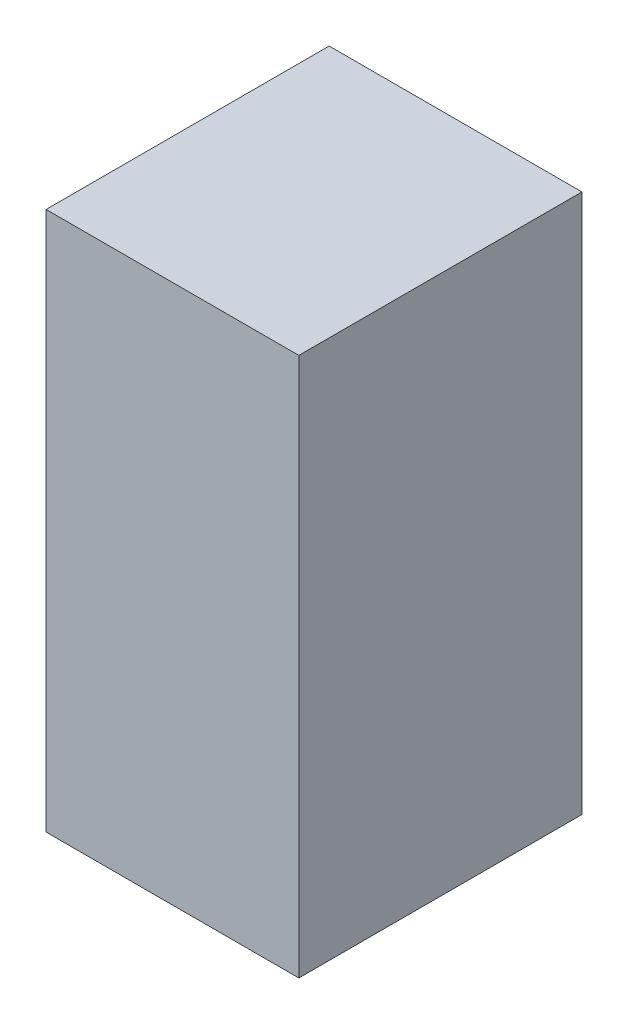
ISO-10303-21;
HEADER;
FILE_DESCRIPTION(('STEP AP214'),'2;1');
FILE_NAME('part.step','',(''),(''),'','','');
FILE_SCHEMA(('AUTOMOTIVE_DESIGN { 1 0 10303 214 1 1 1 1 }'));
ENDSEC;
DATA;
#1=APPLICATION_CONTEXT('core data for automotive mechanical design processes');
#2=APPLICATION_PROTOCOL_DEFINITION('international standard','automotive_design',2000,#1);
#3=PRODUCT_CONTEXT('',#1,'mechanical');
#4=PRODUCT('Part','Part','',(#3));
#5=PRODUCT_RELATED_PRODUCT_CATEGORY('part','',(#4));
#6=PRODUCT_DEFINITION_FORMATION('','',#4);
#7=PRODUCT_DEFINITION_CONTEXT('part definition',#1,'design');
#8=PRODUCT_DEFINITION('design','',#6,#7);
#9=PRODUCT_DEFINITION_SHAPE('','',#8);
#10=(LENGTH_UNIT() NAMED_UNIT(*) SI_UNIT(.MILLI.,.METRE.));
#11=(NAMED_UNIT(*) PLANE_ANGLE_UNIT() SI_UNIT($,.RADIAN.));
#12=(NAMED_UNIT(*) SI_UNIT($,.STERADIAN.) SOLID_ANGLE_UNIT());
#13=UNCERTAINTY_MEASURE_WITH_UNIT(LENGTH_MEASURE(1.E-05),#10,'distance_accuracy_value','');
#14=(GEOMETRIC_REPRESENTATION_CONTEXT(3) GLOBAL_UNCERTAINTY_ASSIGNED_CONTEXT((#13)) GLOBAL_UNIT_ASSIGNED_CONTEXT((#10,
#11,#12)) REPRESENTATION_CONTEXT('',''));
#15=CARTESIAN_POINT('',(0.,0.,0.));
#16=DIRECTION('',(0.,0.,1.));
#17=DIRECTION('',(1.,0.,0.));
#18=AXIS2_PLACEMENT_3D('',#15,#16,#17);
#19=CARTESIAN_POINT('',(-9.52499999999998,40.6400000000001,-10.668));
#20=DIRECTION('',(1.,0.,0.));
#21=DIRECTION('',(0.,0.,-1.));
#22=AXIS2_PLACEMENT_3D('',#19,#20,#21);
#23=PLANE('',#22);
#24=DIRECTION('',(0.,0.,1.));
#25=VECTOR('',#24,1.);
#26=CARTESIAN_POINT('',(-9.52500000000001,0.,-10.668));
#27=LINE('',#26,#25);
#28=CARTESIAN_POINT('',(-9.52500000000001,0.,-10.668));
#29=VERTEX_POINT('',#28);
#30=CARTESIAN_POINT('',(-9.52500000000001,0.,10.668));
#31=VERTEX_POINT('',#30);
#32=EDGE_CURVE('E78',#29,#31,#27,.T.);
#33=ORIENTED_EDGE('',*,*,#32,.T.);
#34=DIRECTION('',(0.,-1.,0.));
#35=VECTOR('',#34,1.);
#36=CARTESIAN_POINT('',(-9.52499999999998,40.64,10.668));
#37=LINE('',#36,#35);
#38=CARTESIAN_POINT('',(-9.52499999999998,40.64,10.668));
#39=VERTEX_POINT('',#38);
#40=EDGE_CURVE('E11',#39,#31,#37,.T.);
#41=ORIENTED_EDGE('',*,*,#40,.F.);
#42=DIRECTION('',(0.,0.,1.));
#43=VECTOR('',#42,1.);
#44=CARTESIAN_POINT('',(-9.52499999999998,40.6400000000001,-10.668));
#45=LINE('',#44,#43);
#46=CARTESIAN_POINT('',(-9.52499999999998,40.6400000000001,-10.668));
#47=VERTEX_POINT('',#46);
#48=EDGE_CURVE('E96',#47,#39,#45,.T.);
#49=ORIENTED_EDGE('',*,*,#48,.F.);
#50=DIRECTION('',(0.,-1.,0.));
#51=VECTOR('',#50,1.);
#52=CARTESIAN_POINT('',(-9.52499999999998,40.6400000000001,-10.668));
#53=LINE('',#52,#51);
#54=EDGE_CURVE('E90',#47,#29,#53,.T.);
#55=ORIENTED_EDGE('',*,*,#54,.T.);
#56=EDGE_LOOP('',(#33,#41,#49,#55));
#57=FACE_BOUND('',#56,.T.);
#58=ADVANCED_FACE('F34',(#57),#23,.F.);
#59=CARTESIAN_POINT('',(-9.52499999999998,40.64,10.668));
#60=DIRECTION('',(0.,0.,-1.));
#61=DIRECTION('',(-1.,0.,0.));
#62=AXIS2_PLACEMENT_3D('',#59,#60,#61);
#63=PLANE('',#62);
#64=DIRECTION('',(1.,0.,0.));
#65=VECTOR('',#64,1.);
#66=CARTESIAN_POINT('',(-9.52500000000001,0.,10.668));
#67=LINE('',#66,#65);
#68=CARTESIAN_POINT('',(9.52499999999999,0.,10.668));
#69=VERTEX_POINT('',#68);
#70=EDGE_CURVE('E74',#31,#69,#67,.T.);
#71=ORIENTED_EDGE('',*,*,#70,.T.);
#72=DIRECTION('',(0.,-1.,0.));
#73=VECTOR('',#72,1.);
#74=CARTESIAN_POINT('',(9.52500000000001,40.64,10.668));
#75=LINE('',#74,#73);
#76=CARTESIAN_POINT('',(9.52500000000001,40.64,10.668));
#77=VERTEX_POINT('',#76);
#78=EDGE_CURVE('E41',#77,#69,#75,.T.);
#79=ORIENTED_EDGE('',*,*,#78,.F.);
#80=DIRECTION('',(1.,0.,0.));
#81=VECTOR('',#80,1.);
#82=CARTESIAN_POINT('',(-9.52499999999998,40.64,10.668));
#83=LINE('',#82,#81);
#84=EDGE_CURVE('E86',#39,#77,#83,.T.);
#85=ORIENTED_EDGE('',*,*,#84,.F.);
#86=ORIENTED_EDGE('',*,*,#40,.T.);
#87=EDGE_LOOP('',(#71,#79,#85,#86));
#88=FACE_BOUND('',#87,.T.);
#89=ADVANCED_FACE('F85',(#88),#63,.F.);
#90=CARTESIAN_POINT('',(9.52500000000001,40.64,-10.668));
#91=DIRECTION('',(-1.,0.,0.));
#92=DIRECTION('',(0.,0.,1.));
#93=AXIS2_PLACEMENT_3D('',#90,#91,#92);
#94=PLANE('',#93);
#95=DIRECTION('',(0.,0.,-1.));
#96=VECTOR('',#95,1.);
#97=CARTESIAN_POINT('',(9.52499999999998,0.,-10.668));
#98=LINE('',#97,#96);
#99=CARTESIAN_POINT('',(9.52499999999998,0.,-10.668));
#100=VERTEX_POINT('',#99);
#101=EDGE_CURVE('E79',#69,#100,#98,.T.);
#102=ORIENTED_EDGE('',*,*,#101,.T.);
#103=DIRECTION('',(0.,-1.,0.));
#104=VECTOR('',#103,1.);
#105=CARTESIAN_POINT('',(9.52500000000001,40.64,-10.668));
#106=LINE('',#105,#104);
#107=CARTESIAN_POINT('',(9.52500000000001,40.64,-10.668));
#108=VERTEX_POINT('',#107);
#109=EDGE_CURVE('E102',#108,#100,#106,.T.);
#110=ORIENTED_EDGE('',*,*,#109,.F.);
#111=DIRECTION('',(0.,0.,-1.));
#112=VECTOR('',#111,1.);
#113=CARTESIAN_POINT('',(9.52500000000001,40.64,-10.668));
#114=LINE('',#113,#112);
#115=EDGE_CURVE('E53',#77,#108,#114,.T.);
#116=ORIENTED_EDGE('',*,*,#115,.F.);
#117=ORIENTED_EDGE('',*,*,#78,.T.);
#118=EDGE_LOOP('',(#102,#110,#116,#117));
#119=FACE_BOUND('',#118,.T.);
#120=ADVANCED_FACE('F105',(#119),#94,.F.);
#121=CARTESIAN_POINT('',(-9.52499999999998,40.6400000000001,-10.668));
#122=DIRECTION('',(0.,0.,1.));
#123=DIRECTION('',(1.,0.,0.));
#124=AXIS2_PLACEMENT_3D('',#121,#122,#123);
#125=PLANE('',#124);
#126=DIRECTION('',(-1.,0.,0.));
#127=VECTOR('',#126,1.);
#128=CARTESIAN_POINT('',(-9.52500000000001,0.,-10.668));
#129=LINE('',#128,#127);
#130=EDGE_CURVE('E94',#100,#29,#129,.T.);
#131=ORIENTED_EDGE('',*,*,#130,.T.);
#132=ORIENTED_EDGE('',*,*,#54,.F.);
#133=DIRECTION('',(-1.,0.,0.));
#134=VECTOR('',#133,1.);
#135=CARTESIAN_POINT('',(-9.52499999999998,40.6400000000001,-10.668));
#136=LINE('',#135,#134);
#137=EDGE_CURVE('E48',#108,#47,#136,.T.);
#138=ORIENTED_EDGE('',*,*,#137,.F.);
#139=ORIENTED_EDGE('',*,*,#109,.T.);
#140=EDGE_LOOP('',(#131,#132,#138,#139));
#141=FACE_BOUND('',#140,.T.);
#142=ADVANCED_FACE('F107',(#141),#125,.F.);
#143=CARTESIAN_POINT('',(-9.52499999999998,40.64,10.668));
#144=DIRECTION('',(0.,1.,0.));
#145=DIRECTION('',(0.,0.,1.));
#146=AXIS2_PLACEMENT_3D('',#143,#144,#145);
#147=PLANE('',#146);
#148=ORIENTED_EDGE('',*,*,#48,.T.);
#149=ORIENTED_EDGE('',*,*,#84,.T.);
#150=ORIENTED_EDGE('',*,*,#115,.T.);
#151=ORIENTED_EDGE('',*,*,#137,.T.);
#152=EDGE_LOOP('',(#148,#149,#150,#151));
#153=FACE_BOUND('',#152,.T.);
#154=ADVANCED_FACE('F108',(#153),#147,.T.);
#155=CARTESIAN_POINT('',(-9.52500000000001,0.,10.668));
#156=DIRECTION('',(0.,1.,0.));
#157=DIRECTION('',(0.,0.,1.));
#158=AXIS2_PLACEMENT_3D('',#155,#156,#157);
#159=PLANE('',#158);
#160=ORIENTED_EDGE('',*,*,#32,.F.);
#161=ORIENTED_EDGE('',*,*,#130,.F.);
#162=ORIENTED_EDGE('',*,*,#101,.F.);
#163=ORIENTED_EDGE('',*,*,#70,.F.);
#164=EDGE_LOOP('',(#160,#161,#162,#163));
#165=FACE_BOUND('',#164,.T.);
#166=ADVANCED_FACE('F75',(#165),#159,.F.);
#167=CLOSED_SHELL('',(#58,#89,#120,#142,#154,#166));
#168=MANIFOLD_SOLID_BREP('B2',#167);
#169=ADVANCED_BREP_SHAPE_REPRESENTATION('',(#18,#168),#14);
#170=SHAPE_DEFINITION_REPRESENTATION(#9,#169);
ENDSEC;
END-ISO-10303-21;
